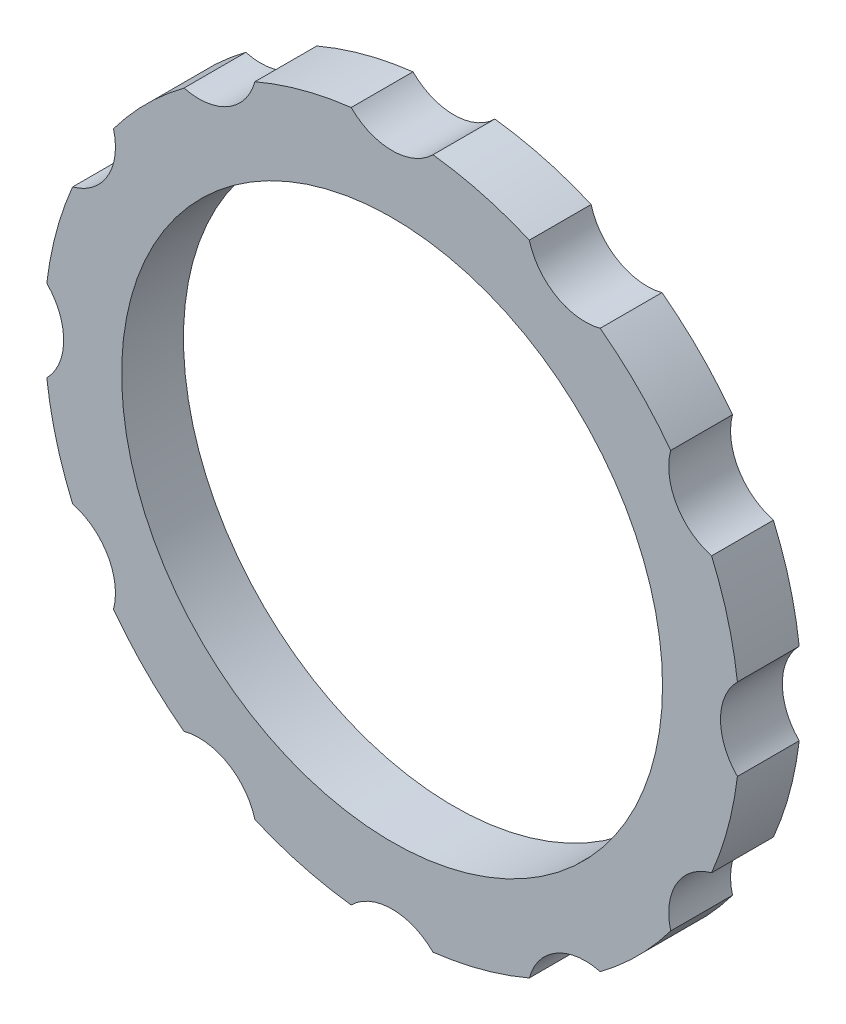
ISO-10303-21;
HEADER;
FILE_DESCRIPTION(('STEP AP214'),'2;1');
FILE_NAME('part.step','',(''),(''),'','','');
FILE_SCHEMA(('AUTOMOTIVE_DESIGN { 1 0 10303 214 1 1 1 1 }'));
ENDSEC;
DATA;
#1=APPLICATION_CONTEXT('core data for automotive mechanical design processes');
#2=APPLICATION_PROTOCOL_DEFINITION('international standard','automotive_design',2000,#1);
#3=PRODUCT_CONTEXT('',#1,'mechanical');
#4=PRODUCT('Part','Part','',(#3));
#5=PRODUCT_RELATED_PRODUCT_CATEGORY('part','',(#4));
#6=PRODUCT_DEFINITION_FORMATION('','',#4);
#7=PRODUCT_DEFINITION_CONTEXT('part definition',#1,'design');
#8=PRODUCT_DEFINITION('design','',#6,#7);
#9=PRODUCT_DEFINITION_SHAPE('','',#8);
#10=(LENGTH_UNIT() NAMED_UNIT(*) SI_UNIT(.MILLI.,.METRE.));
#11=(NAMED_UNIT(*) PLANE_ANGLE_UNIT() SI_UNIT($,.RADIAN.));
#12=(NAMED_UNIT(*) SI_UNIT($,.STERADIAN.) SOLID_ANGLE_UNIT());
#13=UNCERTAINTY_MEASURE_WITH_UNIT(LENGTH_MEASURE(1.E-05),#10,'distance_accuracy_value','');
#14=(GEOMETRIC_REPRESENTATION_CONTEXT(3) GLOBAL_UNCERTAINTY_ASSIGNED_CONTEXT((#13)) GLOBAL_UNIT_ASSIGNED_CONTEXT((#10,
#11,#12)) REPRESENTATION_CONTEXT('',''));
#15=CARTESIAN_POINT('',(0.,0.,0.));
#16=DIRECTION('',(0.,0.,1.));
#17=DIRECTION('',(1.,0.,0.));
#18=AXIS2_PLACEMENT_3D('',#15,#16,#17);
#19=CARTESIAN_POINT('',(0.,0.,5.08));
#20=DIRECTION('',(0.,0.,-1.));
#21=DIRECTION('',(-1.,0.,0.));
#22=AXIS2_PLACEMENT_3D('',#19,#20,#21);
#23=CYLINDRICAL_SURFACE('',#22,28.575);
#24=CARTESIAN_POINT('',(0.,0.,0.));
#25=DIRECTION('',(0.,0.,1.));
#26=DIRECTION('',(1.,0.,0.));
#27=AXIS2_PLACEMENT_3D('',#24,#25,#26);
#28=CIRCLE('',#27,28.575);
#29=CARTESIAN_POINT('',(22.8939517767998,17.0996373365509,0.));
#30=VERTEX_POINT('',#29);
#31=CARTESIAN_POINT('',(17.0996373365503,22.8939517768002,0.));
#32=VERTEX_POINT('',#31);
#33=EDGE_CURVE('E368',#30,#32,#28,.T.);
#34=ORIENTED_EDGE('',*,*,#33,.T.);
#35=DIRECTION('',(0.,0.,1.));
#36=VECTOR('',#35,1.);
#37=CARTESIAN_POINT('',(17.0996373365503,22.8939517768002,2.54));
#38=LINE('',#37,#36);
#39=CARTESIAN_POINT('',(17.0996373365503,22.8939517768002,5.08));
#40=VERTEX_POINT('',#39);
#41=EDGE_CURVE('E11',#32,#40,#38,.T.);
#42=ORIENTED_EDGE('',*,*,#41,.T.);
#43=CARTESIAN_POINT('',(0.,0.,5.08));
#44=DIRECTION('',(0.,0.,1.));
#45=DIRECTION('',(1.,0.,0.));
#46=AXIS2_PLACEMENT_3D('',#43,#44,#45);
#47=CIRCLE('',#46,28.575);
#48=CARTESIAN_POINT('',(22.8939517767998,17.0996373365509,5.08));
#49=VERTEX_POINT('',#48);
#50=EDGE_CURVE('E207',#49,#40,#47,.T.);
#51=ORIENTED_EDGE('',*,*,#50,.F.);
#52=DIRECTION('',(0.,0.,1.));
#53=VECTOR('',#52,1.);
#54=CARTESIAN_POINT('',(22.8939517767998,17.0996373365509,2.54));
#55=LINE('',#54,#53);
#56=EDGE_CURVE('E271',#49,#30,#55,.F.);
#57=ORIENTED_EDGE('',*,*,#56,.T.);
#58=EDGE_LOOP('',(#34,#42,#51,#57));
#59=FACE_BOUND('',#58,.T.);
#60=ADVANCED_FACE('F33',(#59),#23,.T.);
#61=CARTESIAN_POINT('',(28.3765625,3.36174444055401,0.));
#62=VERTEX_POINT('',#61);
#63=CARTESIAN_POINT('',(26.2556962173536,11.2769251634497,0.));
#64=VERTEX_POINT('',#63);
#65=EDGE_CURVE('E270',#62,#64,#28,.T.);
#66=ORIENTED_EDGE('',*,*,#65,.T.);
#67=DIRECTION('',(0.,0.,1.));
#68=VECTOR('',#67,1.);
#69=CARTESIAN_POINT('',(26.2556962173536,11.2769251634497,2.54));
#70=LINE('',#69,#68);
#71=CARTESIAN_POINT('',(26.2556962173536,11.2769251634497,5.08));
#72=VERTEX_POINT('',#71);
#73=EDGE_CURVE('E197',#64,#72,#70,.T.);
#74=ORIENTED_EDGE('',*,*,#73,.T.);
#75=CARTESIAN_POINT('',(28.3765625,3.36174444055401,5.08));
#76=VERTEX_POINT('',#75);
#77=EDGE_CURVE('E215',#76,#72,#47,.T.);
#78=ORIENTED_EDGE('',*,*,#77,.F.);
#79=DIRECTION('',(0.,0.,1.));
#80=VECTOR('',#79,1.);
#81=CARTESIAN_POINT('',(28.3765625,3.36174444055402,2.54));
#82=LINE('',#81,#80);
#83=EDGE_CURVE('E268',#76,#62,#82,.F.);
#84=ORIENTED_EDGE('',*,*,#83,.T.);
#85=EDGE_LOOP('',(#66,#74,#78,#84));
#86=FACE_BOUND('',#85,.T.);
#87=ADVANCED_FACE('F267',(#86),#23,.T.);
#88=CARTESIAN_POINT('',(26.2556962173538,-11.2769251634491,0.));
#89=VERTEX_POINT('',#88);
#90=CARTESIAN_POINT('',(28.3765625,-3.36174444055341,0.));
#91=VERTEX_POINT('',#90);
#92=EDGE_CURVE('E362',#89,#91,#28,.T.);
#93=ORIENTED_EDGE('',*,*,#92,.T.);
#94=DIRECTION('',(0.,0.,1.));
#95=VECTOR('',#94,1.);
#96=CARTESIAN_POINT('',(28.3765625,-3.36174444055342,2.54));
#97=LINE('',#96,#95);
#98=CARTESIAN_POINT('',(28.3765625,-3.36174444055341,5.08));
#99=VERTEX_POINT('',#98);
#100=EDGE_CURVE('E273',#91,#99,#97,.T.);
#101=ORIENTED_EDGE('',*,*,#100,.T.);
#102=CARTESIAN_POINT('',(26.2556962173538,-11.2769251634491,5.08));
#103=VERTEX_POINT('',#102);
#104=EDGE_CURVE('E253',#103,#99,#47,.T.);
#105=ORIENTED_EDGE('',*,*,#104,.F.);
#106=DIRECTION('',(0.,0.,1.));
#107=VECTOR('',#106,1.);
#108=CARTESIAN_POINT('',(26.2556962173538,-11.2769251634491,2.54));
#109=LINE('',#108,#107);
#110=EDGE_CURVE('E282',#103,#89,#109,.F.);
#111=ORIENTED_EDGE('',*,*,#110,.T.);
#112=EDGE_LOOP('',(#93,#101,#105,#111));
#113=FACE_BOUND('',#112,.T.);
#114=ADVANCED_FACE('F449',(#113),#23,.T.);
#115=CARTESIAN_POINT('',(17.0996373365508,-22.8939517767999,0.));
#116=VERTEX_POINT('',#115);
#117=CARTESIAN_POINT('',(22.8939517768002,-17.0996373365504,0.));
#118=VERTEX_POINT('',#117);
#119=EDGE_CURVE('E358',#116,#118,#28,.T.);
#120=ORIENTED_EDGE('',*,*,#119,.T.);
#121=DIRECTION('',(0.,0.,1.));
#122=VECTOR('',#121,1.);
#123=CARTESIAN_POINT('',(22.8939517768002,-17.0996373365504,2.54));
#124=LINE('',#123,#122);
#125=CARTESIAN_POINT('',(22.8939517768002,-17.0996373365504,5.08));
#126=VERTEX_POINT('',#125);
#127=EDGE_CURVE('E279',#118,#126,#124,.T.);
#128=ORIENTED_EDGE('',*,*,#127,.T.);
#129=CARTESIAN_POINT('',(17.0996373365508,-22.8939517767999,5.08));
#130=VERTEX_POINT('',#129);
#131=EDGE_CURVE('E249',#130,#126,#47,.T.);
#132=ORIENTED_EDGE('',*,*,#131,.F.);
#133=DIRECTION('',(0.,0.,1.));
#134=VECTOR('',#133,1.);
#135=CARTESIAN_POINT('',(17.0996373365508,-22.8939517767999,2.54));
#136=LINE('',#135,#134);
#137=EDGE_CURVE('E288',#130,#116,#136,.F.);
#138=ORIENTED_EDGE('',*,*,#137,.T.);
#139=EDGE_LOOP('',(#120,#128,#132,#138));
#140=FACE_BOUND('',#139,.T.);
#141=ADVANCED_FACE('F482',(#140),#23,.T.);
#142=CARTESIAN_POINT('',(3.36174444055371,-28.3765625,0.));
#143=VERTEX_POINT('',#142);
#144=CARTESIAN_POINT('',(11.2769251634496,-26.2556962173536,0.));
#145=VERTEX_POINT('',#144);
#146=EDGE_CURVE('E354',#143,#145,#28,.T.);
#147=ORIENTED_EDGE('',*,*,#146,.T.);
#148=DIRECTION('',(0.,0.,1.));
#149=VECTOR('',#148,1.);
#150=CARTESIAN_POINT('',(11.2769251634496,-26.2556962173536,2.54));
#151=LINE('',#150,#149);
#152=CARTESIAN_POINT('',(11.2769251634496,-26.2556962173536,5.08));
#153=VERTEX_POINT('',#152);
#154=EDGE_CURVE('E285',#145,#153,#151,.T.);
#155=ORIENTED_EDGE('',*,*,#154,.T.);
#156=CARTESIAN_POINT('',(3.36174444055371,-28.3765625,5.08));
#157=VERTEX_POINT('',#156);
#158=EDGE_CURVE('E245',#157,#153,#47,.T.);
#159=ORIENTED_EDGE('',*,*,#158,.F.);
#160=DIRECTION('',(0.,0.,1.));
#161=VECTOR('',#160,1.);
#162=CARTESIAN_POINT('',(3.36174444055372,-28.3765625,2.54));
#163=LINE('',#162,#161);
#164=EDGE_CURVE('E294',#157,#143,#163,.F.);
#165=ORIENTED_EDGE('',*,*,#164,.T.);
#166=EDGE_LOOP('',(#147,#155,#159,#165));
#167=FACE_BOUND('',#166,.T.);
#168=ADVANCED_FACE('F478',(#167),#23,.T.);
#169=CARTESIAN_POINT('',(-11.2769251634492,-26.2556962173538,0.));
#170=VERTEX_POINT('',#169);
#171=CARTESIAN_POINT('',(-3.36174444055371,-28.3765625,0.));
#172=VERTEX_POINT('',#171);
#173=EDGE_CURVE('E350',#170,#172,#28,.T.);
#174=ORIENTED_EDGE('',*,*,#173,.T.);
#175=DIRECTION('',(0.,0.,1.));
#176=VECTOR('',#175,1.);
#177=CARTESIAN_POINT('',(-3.36174444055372,-28.3765625,2.54));
#178=LINE('',#177,#176);
#179=CARTESIAN_POINT('',(-3.36174444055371,-28.3765625,5.08));
#180=VERTEX_POINT('',#179);
#181=EDGE_CURVE('E291',#172,#180,#178,.T.);
#182=ORIENTED_EDGE('',*,*,#181,.T.);
#183=CARTESIAN_POINT('',(-11.2769251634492,-26.2556962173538,5.08));
#184=VERTEX_POINT('',#183);
#185=EDGE_CURVE('E241',#184,#180,#47,.T.);
#186=ORIENTED_EDGE('',*,*,#185,.F.);
#187=DIRECTION('',(0.,0.,1.));
#188=VECTOR('',#187,1.);
#189=CARTESIAN_POINT('',(-11.2769251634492,-26.2556962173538,2.54));
#190=LINE('',#189,#188);
#191=EDGE_CURVE('E300',#184,#170,#190,.F.);
#192=ORIENTED_EDGE('',*,*,#191,.T.);
#193=EDGE_LOOP('',(#174,#182,#186,#192));
#194=FACE_BOUND('',#193,.T.);
#195=ADVANCED_FACE('F474',(#194),#23,.T.);
#196=CARTESIAN_POINT('',(-22.8939517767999,-17.0996373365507,0.));
#197=VERTEX_POINT('',#196);
#198=CARTESIAN_POINT('',(-17.0996373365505,-22.8939517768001,0.));
#199=VERTEX_POINT('',#198);
#200=EDGE_CURVE('E346',#197,#199,#28,.T.);
#201=ORIENTED_EDGE('',*,*,#200,.T.);
#202=DIRECTION('',(0.,0.,1.));
#203=VECTOR('',#202,1.);
#204=CARTESIAN_POINT('',(-17.0996373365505,-22.8939517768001,2.54));
#205=LINE('',#204,#203);
#206=CARTESIAN_POINT('',(-17.0996373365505,-22.8939517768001,5.08));
#207=VERTEX_POINT('',#206);
#208=EDGE_CURVE('E297',#199,#207,#205,.T.);
#209=ORIENTED_EDGE('',*,*,#208,.T.);
#210=CARTESIAN_POINT('',(-22.8939517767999,-17.0996373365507,5.08));
#211=VERTEX_POINT('',#210);
#212=EDGE_CURVE('E237',#211,#207,#47,.T.);
#213=ORIENTED_EDGE('',*,*,#212,.F.);
#214=DIRECTION('',(0.,0.,1.));
#215=VECTOR('',#214,1.);
#216=CARTESIAN_POINT('',(-22.8939517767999,-17.0996373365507,2.54));
#217=LINE('',#216,#215);
#218=EDGE_CURVE('E306',#211,#197,#217,.F.);
#219=ORIENTED_EDGE('',*,*,#218,.T.);
#220=EDGE_LOOP('',(#201,#209,#213,#219));
#221=FACE_BOUND('',#220,.T.);
#222=ADVANCED_FACE('F470',(#221),#23,.T.);
#223=CARTESIAN_POINT('',(-28.3765625,-3.36174444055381,0.));
#224=VERTEX_POINT('',#223);
#225=CARTESIAN_POINT('',(-26.2556962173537,-11.2769251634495,0.));
#226=VERTEX_POINT('',#225);
#227=EDGE_CURVE('E343',#224,#226,#28,.T.);
#228=ORIENTED_EDGE('',*,*,#227,.T.);
#229=DIRECTION('',(0.,0.,1.));
#230=VECTOR('',#229,1.);
#231=CARTESIAN_POINT('',(-26.2556962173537,-11.2769251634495,2.54));
#232=LINE('',#231,#230);
#233=CARTESIAN_POINT('',(-26.2556962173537,-11.2769251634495,5.08));
#234=VERTEX_POINT('',#233);
#235=EDGE_CURVE('E303',#226,#234,#232,.T.);
#236=ORIENTED_EDGE('',*,*,#235,.T.);
#237=CARTESIAN_POINT('',(-28.3765625,-3.36174444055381,5.08));
#238=VERTEX_POINT('',#237);
#239=EDGE_CURVE('E233',#238,#234,#47,.T.);
#240=ORIENTED_EDGE('',*,*,#239,.F.);
#241=DIRECTION('',(0.,0.,1.));
#242=VECTOR('',#241,1.);
#243=CARTESIAN_POINT('',(-28.3765625,-3.36174444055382,2.54));
#244=LINE('',#243,#242);
#245=EDGE_CURVE('E312',#238,#224,#244,.F.);
#246=ORIENTED_EDGE('',*,*,#245,.T.);
#247=EDGE_LOOP('',(#228,#236,#240,#246));
#248=FACE_BOUND('',#247,.T.);
#249=ADVANCED_FACE('F466',(#248),#23,.T.);
#250=CARTESIAN_POINT('',(-26.2556962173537,11.2769251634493,0.));
#251=VERTEX_POINT('',#250);
#252=CARTESIAN_POINT('',(-28.3765625,3.36174444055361,0.));
#253=VERTEX_POINT('',#252);
#254=EDGE_CURVE('E341',#251,#253,#28,.T.);
#255=ORIENTED_EDGE('',*,*,#254,.T.);
#256=DIRECTION('',(0.,0.,1.));
#257=VECTOR('',#256,1.);
#258=CARTESIAN_POINT('',(-28.3765625,3.36174444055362,2.54));
#259=LINE('',#258,#257);
#260=CARTESIAN_POINT('',(-28.3765625,3.36174444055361,5.08));
#261=VERTEX_POINT('',#260);
#262=EDGE_CURVE('E309',#253,#261,#259,.T.);
#263=ORIENTED_EDGE('',*,*,#262,.T.);
#264=CARTESIAN_POINT('',(-26.2556962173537,11.2769251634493,5.08));
#265=VERTEX_POINT('',#264);
#266=EDGE_CURVE('E229',#265,#261,#47,.T.);
#267=ORIENTED_EDGE('',*,*,#266,.F.);
#268=DIRECTION('',(0.,0.,1.));
#269=VECTOR('',#268,1.);
#270=CARTESIAN_POINT('',(-26.2556962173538,11.2769251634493,2.54));
#271=LINE('',#270,#269);
#272=EDGE_CURVE('E318',#265,#251,#271,.F.);
#273=ORIENTED_EDGE('',*,*,#272,.T.);
#274=EDGE_LOOP('',(#255,#263,#267,#273));
#275=FACE_BOUND('',#274,.T.);
#276=ADVANCED_FACE('F462',(#275),#23,.T.);
#277=CARTESIAN_POINT('',(-17.0996373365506,22.8939517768,0.));
#278=VERTEX_POINT('',#277);
#279=CARTESIAN_POINT('',(-22.8939517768,17.0996373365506,0.));
#280=VERTEX_POINT('',#279);
#281=EDGE_CURVE('E217',#278,#280,#28,.T.);
#282=ORIENTED_EDGE('',*,*,#281,.T.);
#283=DIRECTION('',(0.,0.,1.));
#284=VECTOR('',#283,1.);
#285=CARTESIAN_POINT('',(-22.8939517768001,17.0996373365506,2.54));
#286=LINE('',#285,#284);
#287=CARTESIAN_POINT('',(-22.8939517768,17.0996373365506,5.08));
#288=VERTEX_POINT('',#287);
#289=EDGE_CURVE('E315',#280,#288,#286,.T.);
#290=ORIENTED_EDGE('',*,*,#289,.T.);
#291=CARTESIAN_POINT('',(-17.0996373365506,22.8939517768,5.08));
#292=VERTEX_POINT('',#291);
#293=EDGE_CURVE('E223',#292,#288,#47,.T.);
#294=ORIENTED_EDGE('',*,*,#293,.F.);
#295=DIRECTION('',(0.,0.,1.));
#296=VECTOR('',#295,1.);
#297=CARTESIAN_POINT('',(-17.0996373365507,22.8939517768,2.54));
#298=LINE('',#297,#296);
#299=EDGE_CURVE('E324',#292,#278,#298,.F.);
#300=ORIENTED_EDGE('',*,*,#299,.T.);
#301=EDGE_LOOP('',(#282,#290,#294,#300));
#302=FACE_BOUND('',#301,.T.);
#303=ADVANCED_FACE('F330',(#302),#23,.T.);
#304=CARTESIAN_POINT('',(-3.36174444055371,28.3765625,0.));
#305=VERTEX_POINT('',#304);
#306=CARTESIAN_POINT('',(-11.2769251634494,26.2556962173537,0.));
#307=VERTEX_POINT('',#306);
#308=EDGE_CURVE('E212',#305,#307,#28,.T.);
#309=ORIENTED_EDGE('',*,*,#308,.T.);
#310=DIRECTION('',(0.,0.,1.));
#311=VECTOR('',#310,1.);
#312=CARTESIAN_POINT('',(-11.2769251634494,26.2556962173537,2.54));
#313=LINE('',#312,#311);
#314=CARTESIAN_POINT('',(-11.2769251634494,26.2556962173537,5.08));
#315=VERTEX_POINT('',#314);
#316=EDGE_CURVE('E321',#307,#315,#313,.T.);
#317=ORIENTED_EDGE('',*,*,#316,.T.);
#318=CARTESIAN_POINT('',(-3.36174444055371,28.3765625,5.08));
#319=VERTEX_POINT('',#318);
#320=EDGE_CURVE('E214',#319,#315,#47,.T.);
#321=ORIENTED_EDGE('',*,*,#320,.F.);
#322=DIRECTION('',(0.,0.,1.));
#323=VECTOR('',#322,1.);
#324=CARTESIAN_POINT('',(-3.36174444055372,28.3765625,2.54));
#325=LINE('',#324,#323);
#326=EDGE_CURVE('E222',#319,#305,#325,.F.);
#327=ORIENTED_EDGE('',*,*,#326,.T.);
#328=EDGE_LOOP('',(#309,#317,#321,#327));
#329=FACE_BOUND('',#328,.T.);
#330=ADVANCED_FACE('F430',(#329),#23,.T.);
#331=CARTESIAN_POINT('',(0.,0.,5.08));
#332=DIRECTION('',(0.,0.,1.));
#333=DIRECTION('',(1.,0.,0.));
#334=AXIS2_PLACEMENT_3D('',#331,#332,#333);
#335=PLANE('',#334);
#336=CARTESIAN_POINT('',(15.8749999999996,27.4963065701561,5.08));
#337=DIRECTION('',(0.,0.,1.));
#338=DIRECTION('',(0.866025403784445,-0.499999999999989,0.));
#339=AXIS2_PLACEMENT_3D('',#336,#337,#338);
#340=CIRCLE('',#339,4.7625);
#341=CARTESIAN_POINT('',(11.276925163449,26.2556962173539,5.08));
#342=VERTEX_POINT('',#341);
#343=EDGE_CURVE('E193',#342,#40,#340,.T.);
#344=ORIENTED_EDGE('',*,*,#343,.F.);
#345=CARTESIAN_POINT('',(3.36174444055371,28.3765625,5.08));
#346=VERTEX_POINT('',#345);
#347=EDGE_CURVE('E203',#342,#346,#47,.T.);
#348=ORIENTED_EDGE('',*,*,#347,.T.);
#349=CARTESIAN_POINT('',(0.,31.75,5.08));
#350=DIRECTION('',(0.,0.,1.));
#351=DIRECTION('',(1.,0.,0.));
#352=AXIS2_PLACEMENT_3D('',#349,#350,#351);
#353=CIRCLE('',#352,4.7625);
#354=EDGE_CURVE('E381',#319,#346,#353,.T.);
#355=ORIENTED_EDGE('',*,*,#354,.F.);
#356=ORIENTED_EDGE('',*,*,#320,.T.);
#357=CARTESIAN_POINT('',(-15.875,27.4963065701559,5.08));
#358=DIRECTION('',(0.,0.,1.));
#359=DIRECTION('',(0.866025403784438,0.500000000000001,0.));
#360=AXIS2_PLACEMENT_3D('',#357,#358,#359);
#361=CIRCLE('',#360,4.7625);
#362=EDGE_CURVE('E385',#292,#315,#361,.T.);
#363=ORIENTED_EDGE('',*,*,#362,.F.);
#364=ORIENTED_EDGE('',*,*,#293,.T.);
#365=CARTESIAN_POINT('',(-27.496306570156,15.8749999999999,5.08));
#366=DIRECTION('',(0.,0.,1.));
#367=DIRECTION('',(0.499999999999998,0.86602540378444,0.));
#368=AXIS2_PLACEMENT_3D('',#365,#366,#367);
#369=CIRCLE('',#368,4.7625);
#370=EDGE_CURVE('E388',#265,#288,#369,.T.);
#371=ORIENTED_EDGE('',*,*,#370,.F.);
#372=ORIENTED_EDGE('',*,*,#266,.T.);
#373=CARTESIAN_POINT('',(-31.75,-1.10854532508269E-13,5.08));
#374=DIRECTION('',(0.,0.,1.));
#375=DIRECTION('',(0.,1.,0.));
#376=AXIS2_PLACEMENT_3D('',#373,#374,#375);
#377=CIRCLE('',#376,4.7625);
#378=EDGE_CURVE('E392',#238,#261,#377,.T.);
#379=ORIENTED_EDGE('',*,*,#378,.F.);
#380=ORIENTED_EDGE('',*,*,#239,.T.);
#381=CARTESIAN_POINT('',(-27.4963065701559,-15.8750000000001,5.08));
#382=DIRECTION('',(0.,0.,1.));
#383=DIRECTION('',(-0.500000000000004,0.866025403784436,0.));
#384=AXIS2_PLACEMENT_3D('',#381,#382,#383);
#385=CIRCLE('',#384,4.7625);
#386=EDGE_CURVE('E397',#211,#234,#385,.T.);
#387=ORIENTED_EDGE('',*,*,#386,.F.);
#388=ORIENTED_EDGE('',*,*,#212,.T.);
#389=CARTESIAN_POINT('',(-15.8749999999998,-27.496306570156,5.08));
#390=DIRECTION('',(0.,0.,1.));
#391=DIRECTION('',(-0.866025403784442,0.499999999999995,0.));
#392=AXIS2_PLACEMENT_3D('',#389,#390,#391);
#393=CIRCLE('',#392,4.7625);
#394=EDGE_CURVE('E402',#184,#207,#393,.T.);
#395=ORIENTED_EDGE('',*,*,#394,.F.);
#396=ORIENTED_EDGE('',*,*,#185,.T.);
#397=CARTESIAN_POINT('',(0.,-31.75,5.08));
#398=DIRECTION('',(0.,0.,1.));
#399=DIRECTION('',(-1.,0.,0.));
#400=AXIS2_PLACEMENT_3D('',#397,#398,#399);
#401=CIRCLE('',#400,4.7625);
#402=EDGE_CURVE('E407',#157,#180,#401,.T.);
#403=ORIENTED_EDGE('',*,*,#402,.F.);
#404=ORIENTED_EDGE('',*,*,#158,.T.);
#405=CARTESIAN_POINT('',(15.8750000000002,-27.4963065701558,5.08));
#406=DIRECTION('',(0.,0.,1.));
#407=DIRECTION('',(-0.866025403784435,-0.500000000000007,0.));
#408=AXIS2_PLACEMENT_3D('',#405,#406,#407);
#409=CIRCLE('',#408,4.7625);
#410=EDGE_CURVE('E412',#130,#153,#409,.T.);
#411=ORIENTED_EDGE('',*,*,#410,.F.);
#412=ORIENTED_EDGE('',*,*,#131,.T.);
#413=CARTESIAN_POINT('',(27.4963065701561,-15.8749999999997,5.08));
#414=DIRECTION('',(0.,0.,1.));
#415=DIRECTION('',(-0.499999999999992,-0.866025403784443,0.));
#416=AXIS2_PLACEMENT_3D('',#413,#414,#415);
#417=CIRCLE('',#416,4.7625);
#418=EDGE_CURVE('E417',#103,#126,#417,.T.);
#419=ORIENTED_EDGE('',*,*,#418,.F.);
#420=ORIENTED_EDGE('',*,*,#104,.T.);
#421=CARTESIAN_POINT('',(31.75,3.32563597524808E-13,5.08));
#422=DIRECTION('',(0.,0.,1.));
#423=DIRECTION('',(0.,-1.,0.));
#424=AXIS2_PLACEMENT_3D('',#421,#422,#423);
#425=CIRCLE('',#424,4.7625);
#426=EDGE_CURVE('E262',#76,#99,#425,.T.);
#427=ORIENTED_EDGE('',*,*,#426,.F.);
#428=ORIENTED_EDGE('',*,*,#77,.T.);
#429=CARTESIAN_POINT('',(27.4963065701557,15.8750000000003,5.08));
#430=DIRECTION('',(0.,0.,1.));
#431=DIRECTION('',(0.50000000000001,-0.866025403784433,0.));
#432=AXIS2_PLACEMENT_3D('',#429,#430,#431);
#433=CIRCLE('',#432,4.7625);
#434=EDGE_CURVE('E261',#49,#72,#433,.T.);
#435=ORIENTED_EDGE('',*,*,#434,.F.);
#436=ORIENTED_EDGE('',*,*,#50,.T.);
#437=EDGE_LOOP('',(#344,#348,#355,#356,#363,#364,#371,#372,#379,#380,#387,#388,#395,#396,#403,
#404,#411,#412,#419,#420,#427,#428,#435,#436));
#438=FACE_BOUND('',#437,.T.);
#439=CARTESIAN_POINT('',(0.,0.,5.08));
#440=DIRECTION('',(0.,0.,1.));
#441=DIRECTION('',(1.,0.,0.));
#442=AXIS2_PLACEMENT_3D('',#439,#440,#441);
#443=CIRCLE('',#442,22.225);
#444=CARTESIAN_POINT('',(22.225,0.,5.08));
#445=VERTEX_POINT('',#444);
#446=EDGE_CURVE('E372',#445,#445,#443,.T.);
#447=ORIENTED_EDGE('',*,*,#446,.F.);
#448=EDGE_LOOP('',(#447));
#449=FACE_BOUND('',#448,.T.);
#450=ADVANCED_FACE('F200',(#438,#449),#335,.T.);
#451=CARTESIAN_POINT('',(0.,0.,0.));
#452=DIRECTION('',(0.,0.,1.));
#453=DIRECTION('',(1.,0.,0.));
#454=AXIS2_PLACEMENT_3D('',#451,#452,#453);
#455=PLANE('',#454);
#456=CARTESIAN_POINT('',(11.276925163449,26.2556962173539,0.));
#457=VERTEX_POINT('',#456);
#458=CARTESIAN_POINT('',(3.36174444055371,28.3765625,0.));
#459=VERTEX_POINT('',#458);
#460=EDGE_CURVE('E219',#457,#459,#28,.T.);
#461=ORIENTED_EDGE('',*,*,#460,.F.);
#462=CARTESIAN_POINT('',(15.8749999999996,27.4963065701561,0.));
#463=DIRECTION('',(0.,0.,1.));
#464=DIRECTION('',(0.866025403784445,-0.499999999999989,0.));
#465=AXIS2_PLACEMENT_3D('',#462,#463,#464);
#466=CIRCLE('',#465,4.7625);
#467=EDGE_CURVE('E48',#457,#32,#466,.T.);
#468=ORIENTED_EDGE('',*,*,#467,.T.);
#469=ORIENTED_EDGE('',*,*,#33,.F.);
#470=CARTESIAN_POINT('',(27.4963065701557,15.8750000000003,0.));
#471=DIRECTION('',(0.,0.,1.));
#472=DIRECTION('',(0.50000000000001,-0.866025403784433,0.));
#473=AXIS2_PLACEMENT_3D('',#470,#471,#472);
#474=CIRCLE('',#473,4.7625);
#475=EDGE_CURVE('E56',#30,#64,#474,.T.);
#476=ORIENTED_EDGE('',*,*,#475,.T.);
#477=ORIENTED_EDGE('',*,*,#65,.F.);
#478=CARTESIAN_POINT('',(31.75,3.32563597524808E-13,0.));
#479=DIRECTION('',(0.,0.,1.));
#480=DIRECTION('',(0.,-1.,0.));
#481=AXIS2_PLACEMENT_3D('',#478,#479,#480);
#482=CIRCLE('',#481,4.7625);
#483=EDGE_CURVE('E419',#62,#91,#482,.T.);
#484=ORIENTED_EDGE('',*,*,#483,.T.);
#485=ORIENTED_EDGE('',*,*,#92,.F.);
#486=CARTESIAN_POINT('',(27.4963065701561,-15.8749999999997,0.));
#487=DIRECTION('',(0.,0.,1.));
#488=DIRECTION('',(-0.499999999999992,-0.866025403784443,0.));
#489=AXIS2_PLACEMENT_3D('',#486,#487,#488);
#490=CIRCLE('',#489,4.7625);
#491=EDGE_CURVE('E414',#89,#118,#490,.T.);
#492=ORIENTED_EDGE('',*,*,#491,.T.);
#493=ORIENTED_EDGE('',*,*,#119,.F.);
#494=CARTESIAN_POINT('',(15.8750000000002,-27.4963065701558,0.));
#495=DIRECTION('',(0.,0.,1.));
#496=DIRECTION('',(-0.866025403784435,-0.500000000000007,0.));
#497=AXIS2_PLACEMENT_3D('',#494,#495,#496);
#498=CIRCLE('',#497,4.7625);
#499=EDGE_CURVE('E409',#116,#145,#498,.T.);
#500=ORIENTED_EDGE('',*,*,#499,.T.);
#501=ORIENTED_EDGE('',*,*,#146,.F.);
#502=CARTESIAN_POINT('',(0.,-31.75,0.));
#503=DIRECTION('',(0.,0.,1.));
#504=DIRECTION('',(-1.,0.,0.));
#505=AXIS2_PLACEMENT_3D('',#502,#503,#504);
#506=CIRCLE('',#505,4.7625);
#507=EDGE_CURVE('E404',#143,#172,#506,.T.);
#508=ORIENTED_EDGE('',*,*,#507,.T.);
#509=ORIENTED_EDGE('',*,*,#173,.F.);
#510=CARTESIAN_POINT('',(-15.8749999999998,-27.496306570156,0.));
#511=DIRECTION('',(0.,0.,1.));
#512=DIRECTION('',(-0.866025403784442,0.499999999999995,0.));
#513=AXIS2_PLACEMENT_3D('',#510,#511,#512);
#514=CIRCLE('',#513,4.7625);
#515=EDGE_CURVE('E399',#170,#199,#514,.T.);
#516=ORIENTED_EDGE('',*,*,#515,.T.);
#517=ORIENTED_EDGE('',*,*,#200,.F.);
#518=CARTESIAN_POINT('',(-27.4963065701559,-15.8750000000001,0.));
#519=DIRECTION('',(0.,0.,1.));
#520=DIRECTION('',(-0.500000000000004,0.866025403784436,0.));
#521=AXIS2_PLACEMENT_3D('',#518,#519,#520);
#522=CIRCLE('',#521,4.7625);
#523=EDGE_CURVE('E394',#197,#226,#522,.T.);
#524=ORIENTED_EDGE('',*,*,#523,.T.);
#525=ORIENTED_EDGE('',*,*,#227,.F.);
#526=CARTESIAN_POINT('',(-31.75,-1.10854532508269E-13,0.));
#527=DIRECTION('',(0.,0.,1.));
#528=DIRECTION('',(0.,1.,0.));
#529=AXIS2_PLACEMENT_3D('',#526,#527,#528);
#530=CIRCLE('',#529,4.7625);
#531=EDGE_CURVE('E390',#224,#253,#530,.T.);
#532=ORIENTED_EDGE('',*,*,#531,.T.);
#533=ORIENTED_EDGE('',*,*,#254,.F.);
#534=CARTESIAN_POINT('',(-27.496306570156,15.8749999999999,0.));
#535=DIRECTION('',(0.,0.,1.));
#536=DIRECTION('',(0.499999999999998,0.86602540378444,0.));
#537=AXIS2_PLACEMENT_3D('',#534,#535,#536);
#538=CIRCLE('',#537,4.7625);
#539=EDGE_CURVE('E340',#251,#280,#538,.T.);
#540=ORIENTED_EDGE('',*,*,#539,.T.);
#541=ORIENTED_EDGE('',*,*,#281,.F.);
#542=CARTESIAN_POINT('',(-15.875,27.4963065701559,0.));
#543=DIRECTION('',(0.,0.,1.));
#544=DIRECTION('',(0.866025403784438,0.500000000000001,0.));
#545=AXIS2_PLACEMENT_3D('',#542,#543,#544);
#546=CIRCLE('',#545,4.7625);
#547=EDGE_CURVE('E338',#278,#307,#546,.T.);
#548=ORIENTED_EDGE('',*,*,#547,.T.);
#549=ORIENTED_EDGE('',*,*,#308,.F.);
#550=CARTESIAN_POINT('',(0.,31.75,0.));
#551=DIRECTION('',(0.,0.,1.));
#552=DIRECTION('',(1.,0.,0.));
#553=AXIS2_PLACEMENT_3D('',#550,#551,#552);
#554=CIRCLE('',#553,4.7625);
#555=EDGE_CURVE('E379',#305,#459,#554,.T.);
#556=ORIENTED_EDGE('',*,*,#555,.T.);
#557=EDGE_LOOP('',(#461,#468,#469,#476,#477,#484,#485,#492,#493,#500,#501,#508,#509,#516,#517,
#524,#525,#532,#533,#540,#541,#548,#549,#556));
#558=FACE_BOUND('',#557,.T.);
#559=CARTESIAN_POINT('',(0.,0.,0.));
#560=DIRECTION('',(0.,0.,1.));
#561=DIRECTION('',(1.,0.,0.));
#562=AXIS2_PLACEMENT_3D('',#559,#560,#561);
#563=CIRCLE('',#562,22.225);
#564=CARTESIAN_POINT('',(22.225,0.,0.));
#565=VERTEX_POINT('',#564);
#566=EDGE_CURVE('E374',#565,#565,#563,.T.);
#567=ORIENTED_EDGE('',*,*,#566,.T.);
#568=EDGE_LOOP('',(#567));
#569=FACE_BOUND('',#568,.T.);
#570=ADVANCED_FACE('F335',(#558,#569),#455,.F.);
#571=ORIENTED_EDGE('',*,*,#347,.F.);
#572=DIRECTION('',(0.,0.,1.));
#573=VECTOR('',#572,1.);
#574=CARTESIAN_POINT('',(11.276925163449,26.2556962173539,2.54));
#575=LINE('',#574,#573);
#576=EDGE_CURVE('E41',#342,#457,#575,.F.);
#577=ORIENTED_EDGE('',*,*,#576,.T.);
#578=ORIENTED_EDGE('',*,*,#460,.T.);
#579=DIRECTION('',(0.,0.,1.));
#580=VECTOR('',#579,1.);
#581=CARTESIAN_POINT('',(3.36174444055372,28.3765625,2.54));
#582=LINE('',#581,#580);
#583=EDGE_CURVE('E211',#459,#346,#582,.T.);
#584=ORIENTED_EDGE('',*,*,#583,.T.);
#585=EDGE_LOOP('',(#571,#577,#578,#584));
#586=FACE_BOUND('',#585,.T.);
#587=ADVANCED_FACE('F35',(#586),#23,.T.);
#588=CARTESIAN_POINT('',(0.,0.,5.08));
#589=DIRECTION('',(0.,0.,-1.));
#590=DIRECTION('',(-1.,0.,0.));
#591=AXIS2_PLACEMENT_3D('',#588,#589,#590);
#592=CYLINDRICAL_SURFACE('',#591,22.225);
#593=ORIENTED_EDGE('',*,*,#446,.T.);
#594=EDGE_LOOP('',(#593));
#595=FACE_BOUND('',#594,.T.);
#596=ORIENTED_EDGE('',*,*,#566,.F.);
#597=EDGE_LOOP('',(#596));
#598=FACE_BOUND('',#597,.T.);
#599=ADVANCED_FACE('F442',(#595,#598),#592,.F.);
#600=CARTESIAN_POINT('',(0.,31.75,0.));
#601=DIRECTION('',(0.,0.,1.));
#602=DIRECTION('',(1.,0.,0.));
#603=AXIS2_PLACEMENT_3D('',#600,#601,#602);
#604=CYLINDRICAL_SURFACE('',#603,4.7625);
#605=ORIENTED_EDGE('',*,*,#555,.F.);
#606=ORIENTED_EDGE('',*,*,#326,.F.);
#607=ORIENTED_EDGE('',*,*,#354,.T.);
#608=ORIENTED_EDGE('',*,*,#583,.F.);
#609=EDGE_LOOP('',(#605,#606,#607,#608));
#610=FACE_BOUND('',#609,.T.);
#611=ADVANCED_FACE('F428',(#610),#604,.F.);
#612=CARTESIAN_POINT('',(-15.875,27.4963065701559,0.));
#613=DIRECTION('',(0.,0.,1.));
#614=DIRECTION('',(1.,0.,0.));
#615=AXIS2_PLACEMENT_3D('',#612,#613,#614);
#616=CYLINDRICAL_SURFACE('',#615,4.7625);
#617=ORIENTED_EDGE('',*,*,#547,.F.);
#618=ORIENTED_EDGE('',*,*,#299,.F.);
#619=ORIENTED_EDGE('',*,*,#362,.T.);
#620=ORIENTED_EDGE('',*,*,#316,.F.);
#621=EDGE_LOOP('',(#617,#618,#619,#620));
#622=FACE_BOUND('',#621,.T.);
#623=ADVANCED_FACE('F431',(#622),#616,.F.);
#624=CARTESIAN_POINT('',(-27.496306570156,15.8749999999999,0.));
#625=DIRECTION('',(0.,0.,1.));
#626=DIRECTION('',(1.,0.,0.));
#627=AXIS2_PLACEMENT_3D('',#624,#625,#626);
#628=CYLINDRICAL_SURFACE('',#627,4.7625);
#629=ORIENTED_EDGE('',*,*,#539,.F.);
#630=ORIENTED_EDGE('',*,*,#272,.F.);
#631=ORIENTED_EDGE('',*,*,#370,.T.);
#632=ORIENTED_EDGE('',*,*,#289,.F.);
#633=EDGE_LOOP('',(#629,#630,#631,#632));
#634=FACE_BOUND('',#633,.T.);
#635=ADVANCED_FACE('F433',(#634),#628,.F.);
#636=CARTESIAN_POINT('',(-31.75,-1.10854532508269E-13,0.));
#637=DIRECTION('',(0.,0.,1.));
#638=DIRECTION('',(1.,0.,0.));
#639=AXIS2_PLACEMENT_3D('',#636,#637,#638);
#640=CYLINDRICAL_SURFACE('',#639,4.7625);
#641=ORIENTED_EDGE('',*,*,#531,.F.);
#642=ORIENTED_EDGE('',*,*,#245,.F.);
#643=ORIENTED_EDGE('',*,*,#378,.T.);
#644=ORIENTED_EDGE('',*,*,#262,.F.);
#645=EDGE_LOOP('',(#641,#642,#643,#644));
#646=FACE_BOUND('',#645,.T.);
#647=ADVANCED_FACE('F439',(#646),#640,.F.);
#648=CARTESIAN_POINT('',(-27.4963065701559,-15.8750000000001,0.));
#649=DIRECTION('',(0.,0.,1.));
#650=DIRECTION('',(1.,0.,0.));
#651=AXIS2_PLACEMENT_3D('',#648,#649,#650);
#652=CYLINDRICAL_SURFACE('',#651,4.7625);
#653=ORIENTED_EDGE('',*,*,#523,.F.);
#654=ORIENTED_EDGE('',*,*,#218,.F.);
#655=ORIENTED_EDGE('',*,*,#386,.T.);
#656=ORIENTED_EDGE('',*,*,#235,.F.);
#657=EDGE_LOOP('',(#653,#654,#655,#656));
#658=FACE_BOUND('',#657,.T.);
#659=ADVANCED_FACE('F519',(#658),#652,.F.);
#660=CARTESIAN_POINT('',(-15.8749999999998,-27.496306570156,0.));
#661=DIRECTION('',(0.,0.,1.));
#662=DIRECTION('',(1.,0.,0.));
#663=AXIS2_PLACEMENT_3D('',#660,#661,#662);
#664=CYLINDRICAL_SURFACE('',#663,4.7625);
#665=ORIENTED_EDGE('',*,*,#515,.F.);
#666=ORIENTED_EDGE('',*,*,#191,.F.);
#667=ORIENTED_EDGE('',*,*,#394,.T.);
#668=ORIENTED_EDGE('',*,*,#208,.F.);
#669=EDGE_LOOP('',(#665,#666,#667,#668));
#670=FACE_BOUND('',#669,.T.);
#671=ADVANCED_FACE('F528',(#670),#664,.F.);
#672=CARTESIAN_POINT('',(0.,-31.75,0.));
#673=DIRECTION('',(0.,0.,1.));
#674=DIRECTION('',(1.,0.,0.));
#675=AXIS2_PLACEMENT_3D('',#672,#673,#674);
#676=CYLINDRICAL_SURFACE('',#675,4.7625);
#677=ORIENTED_EDGE('',*,*,#507,.F.);
#678=ORIENTED_EDGE('',*,*,#164,.F.);
#679=ORIENTED_EDGE('',*,*,#402,.T.);
#680=ORIENTED_EDGE('',*,*,#181,.F.);
#681=EDGE_LOOP('',(#677,#678,#679,#680));
#682=FACE_BOUND('',#681,.T.);
#683=ADVANCED_FACE('F537',(#682),#676,.F.);
#684=CARTESIAN_POINT('',(15.8750000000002,-27.4963065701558,0.));
#685=DIRECTION('',(0.,0.,1.));
#686=DIRECTION('',(1.,0.,0.));
#687=AXIS2_PLACEMENT_3D('',#684,#685,#686);
#688=CYLINDRICAL_SURFACE('',#687,4.7625);
#689=ORIENTED_EDGE('',*,*,#499,.F.);
#690=ORIENTED_EDGE('',*,*,#137,.F.);
#691=ORIENTED_EDGE('',*,*,#410,.T.);
#692=ORIENTED_EDGE('',*,*,#154,.F.);
#693=EDGE_LOOP('',(#689,#690,#691,#692));
#694=FACE_BOUND('',#693,.T.);
#695=ADVANCED_FACE('F546',(#694),#688,.F.);
#696=CARTESIAN_POINT('',(27.4963065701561,-15.8749999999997,0.));
#697=DIRECTION('',(0.,0.,1.));
#698=DIRECTION('',(1.,0.,0.));
#699=AXIS2_PLACEMENT_3D('',#696,#697,#698);
#700=CYLINDRICAL_SURFACE('',#699,4.7625);
#701=ORIENTED_EDGE('',*,*,#491,.F.);
#702=ORIENTED_EDGE('',*,*,#110,.F.);
#703=ORIENTED_EDGE('',*,*,#418,.T.);
#704=ORIENTED_EDGE('',*,*,#127,.F.);
#705=EDGE_LOOP('',(#701,#702,#703,#704));
#706=FACE_BOUND('',#705,.T.);
#707=ADVANCED_FACE('F555',(#706),#700,.F.);
#708=CARTESIAN_POINT('',(31.75,3.32563597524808E-13,0.));
#709=DIRECTION('',(0.,0.,1.));
#710=DIRECTION('',(1.,0.,0.));
#711=AXIS2_PLACEMENT_3D('',#708,#709,#710);
#712=CYLINDRICAL_SURFACE('',#711,4.7625);
#713=ORIENTED_EDGE('',*,*,#483,.F.);
#714=ORIENTED_EDGE('',*,*,#83,.F.);
#715=ORIENTED_EDGE('',*,*,#426,.T.);
#716=ORIENTED_EDGE('',*,*,#100,.F.);
#717=EDGE_LOOP('',(#713,#714,#715,#716));
#718=FACE_BOUND('',#717,.T.);
#719=ADVANCED_FACE('F564',(#718),#712,.F.);
#720=CARTESIAN_POINT('',(27.4963065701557,15.8750000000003,0.));
#721=DIRECTION('',(0.,0.,1.));
#722=DIRECTION('',(1.,0.,0.));
#723=AXIS2_PLACEMENT_3D('',#720,#721,#722);
#724=CYLINDRICAL_SURFACE('',#723,4.7625);
#725=ORIENTED_EDGE('',*,*,#475,.F.);
#726=ORIENTED_EDGE('',*,*,#56,.F.);
#727=ORIENTED_EDGE('',*,*,#434,.T.);
#728=ORIENTED_EDGE('',*,*,#73,.F.);
#729=EDGE_LOOP('',(#725,#726,#727,#728));
#730=FACE_BOUND('',#729,.T.);
#731=ADVANCED_FACE('F573',(#730),#724,.F.);
#732=CARTESIAN_POINT('',(15.8749999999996,27.4963065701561,0.));
#733=DIRECTION('',(0.,0.,1.));
#734=DIRECTION('',(1.,0.,0.));
#735=AXIS2_PLACEMENT_3D('',#732,#733,#734);
#736=CYLINDRICAL_SURFACE('',#735,4.7625);
#737=ORIENTED_EDGE('',*,*,#467,.F.);
#738=ORIENTED_EDGE('',*,*,#576,.F.);
#739=ORIENTED_EDGE('',*,*,#343,.T.);
#740=ORIENTED_EDGE('',*,*,#41,.F.);
#741=EDGE_LOOP('',(#737,#738,#739,#740));
#742=FACE_BOUND('',#741,.T.);
#743=ADVANCED_FACE('F192',(#742),#736,.F.);
#744=CLOSED_SHELL('',(#60,#87,#114,#141,#168,#195,#222,#249,#276,#303,#330,#450,#570,#587,#599,
#611,#623,#635,#647,#659,#671,#683,#695,#707,#719,#731,#743));
#745=MANIFOLD_SOLID_BREP('B2',#744);
#746=ADVANCED_BREP_SHAPE_REPRESENTATION('',(#18,#745),#14);
#747=SHAPE_DEFINITION_REPRESENTATION(#9,#746);
ENDSEC;
END-ISO-10303-21;
